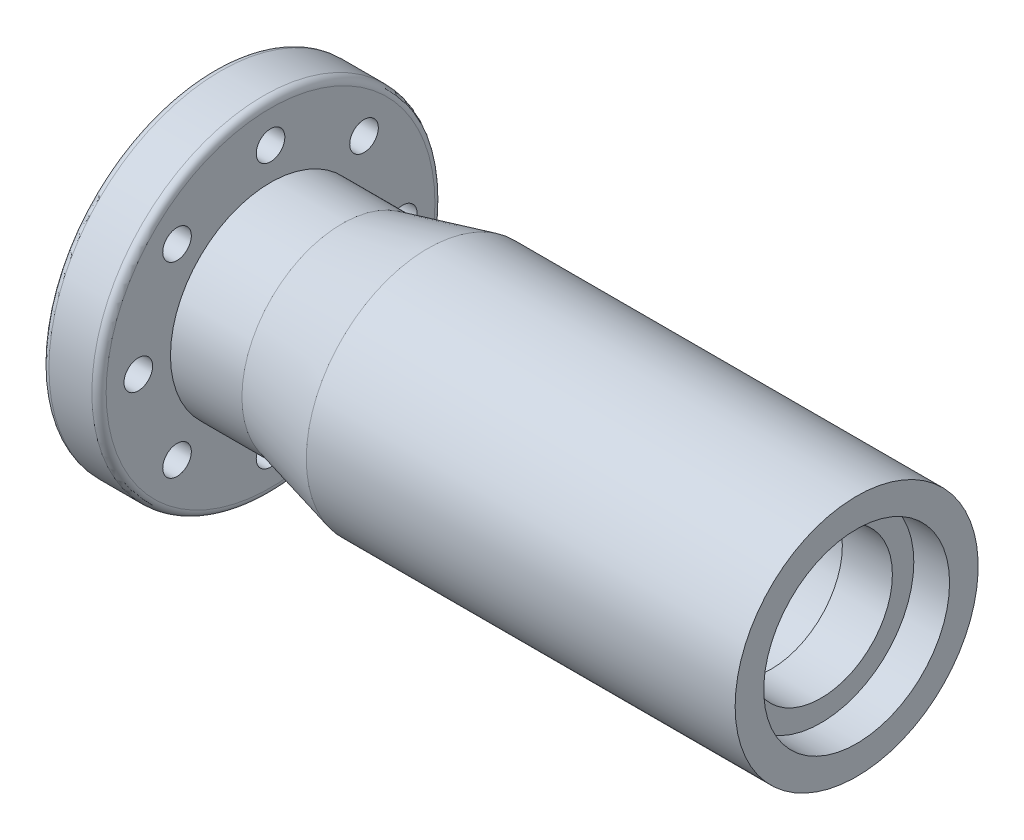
ISO-10303-21;
HEADER;
FILE_DESCRIPTION(('STEP AP214'),'2;1');
FILE_NAME('part.step','',(''),(''),'','','');
FILE_SCHEMA(('AUTOMOTIVE_DESIGN { 1 0 10303 214 1 1 1 1 }'));
ENDSEC;
DATA;
#1=APPLICATION_CONTEXT('core data for automotive mechanical design processes');
#2=APPLICATION_PROTOCOL_DEFINITION('international standard','automotive_design',2000,#1);
#3=PRODUCT_CONTEXT('',#1,'mechanical');
#4=PRODUCT('Part','Part','',(#3));
#5=PRODUCT_RELATED_PRODUCT_CATEGORY('part','',(#4));
#6=PRODUCT_DEFINITION_FORMATION('','',#4);
#7=PRODUCT_DEFINITION_CONTEXT('part definition',#1,'design');
#8=PRODUCT_DEFINITION('design','',#6,#7);
#9=PRODUCT_DEFINITION_SHAPE('','',#8);
#10=(LENGTH_UNIT() NAMED_UNIT(*) SI_UNIT(.MILLI.,.METRE.));
#11=(NAMED_UNIT(*) PLANE_ANGLE_UNIT() SI_UNIT($,.RADIAN.));
#12=(NAMED_UNIT(*) SI_UNIT($,.STERADIAN.) SOLID_ANGLE_UNIT());
#13=UNCERTAINTY_MEASURE_WITH_UNIT(LENGTH_MEASURE(1.E-05),#10,'distance_accuracy_value','');
#14=(GEOMETRIC_REPRESENTATION_CONTEXT(3) GLOBAL_UNCERTAINTY_ASSIGNED_CONTEXT((#13)) GLOBAL_UNIT_ASSIGNED_CONTEXT((#10,
#11,#12)) REPRESENTATION_CONTEXT('',''));
#15=CARTESIAN_POINT('',(0.,0.,0.));
#16=DIRECTION('',(0.,0.,1.));
#17=DIRECTION('',(1.,0.,0.));
#18=AXIS2_PLACEMENT_3D('',#15,#16,#17);
#19=CARTESIAN_POINT('',(0.,0.,0.));
#20=DIRECTION('',(1.,0.,0.));
#21=DIRECTION('',(0.,0.,-1.));
#22=AXIS2_PLACEMENT_3D('',#19,#20,#21);
#23=CYLINDRICAL_SURFACE('',#22,10.);
#24=CARTESIAN_POINT('',(85.,0.,0.));
#25=DIRECTION('',(1.,0.,0.));
#26=DIRECTION('',(0.,0.,-1.));
#27=AXIS2_PLACEMENT_3D('',#24,#25,#26);
#28=CIRCLE('',#27,10.);
#29=CARTESIAN_POINT('',(85.,0.,-10.));
#30=VERTEX_POINT('',#29);
#31=EDGE_CURVE('E96',#30,#30,#28,.T.);
#32=ORIENTED_EDGE('',*,*,#31,.T.);
#33=EDGE_LOOP('',(#32));
#34=FACE_BOUND('',#33,.T.);
#35=CARTESIAN_POINT('',(78.,0.,0.));
#36=DIRECTION('',(-1.,0.,0.));
#37=DIRECTION('',(0.,0.,1.));
#38=AXIS2_PLACEMENT_3D('',#35,#36,#37);
#39=CIRCLE('',#38,10.);
#40=CARTESIAN_POINT('',(78.,0.,10.));
#41=VERTEX_POINT('',#40);
#42=EDGE_CURVE('E93',#41,#41,#39,.F.);
#43=ORIENTED_EDGE('',*,*,#42,.F.);
#44=EDGE_LOOP('',(#43));
#45=FACE_BOUND('',#44,.T.);
#46=ADVANCED_FACE('F33',(#34,#45),#23,.F.);
#47=CARTESIAN_POINT('',(0.,0.,0.));
#48=DIRECTION('',(1.,0.,0.));
#49=DIRECTION('',(0.,0.,-1.));
#50=AXIS2_PLACEMENT_3D('',#47,#48,#49);
#51=PLANE('',#50);
#52=CARTESIAN_POINT('',(0.,0.,0.));
#53=DIRECTION('',(1.,0.,0.));
#54=DIRECTION('',(0.,0.,-1.));
#55=AXIS2_PLACEMENT_3D('',#52,#53,#54);
#56=CIRCLE('',#55,23.);
#57=CARTESIAN_POINT('',(0.,0.,-23.));
#58=VERTEX_POINT('',#57);
#59=EDGE_CURVE('E10',#58,#58,#56,.F.);
#60=ORIENTED_EDGE('',*,*,#59,.T.);
#61=EDGE_LOOP('',(#60));
#62=FACE_BOUND('',#61,.T.);
#63=CARTESIAN_POINT('',(0.,13.0814754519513,13.081475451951));
#64=DIRECTION('',(-1.,0.,0.));
#65=DIRECTION('',(0.,-0.707106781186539,0.707106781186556));
#66=AXIS2_PLACEMENT_3D('',#63,#64,#65);
#67=CIRCLE('',#66,2.);
#68=CARTESIAN_POINT('',(0.,11.6672618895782,14.4956890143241));
#69=VERTEX_POINT('',#68);
#70=EDGE_CURVE('E58',#69,#69,#67,.T.);
#71=ORIENTED_EDGE('',*,*,#70,.F.);
#72=EDGE_LOOP('',(#71));
#73=FACE_BOUND('',#72,.T.);
#74=CARTESIAN_POINT('',(0.,1.93777326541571E-13,18.5));
#75=DIRECTION('',(-1.,0.,0.));
#76=DIRECTION('',(0.,-1.,0.));
#77=AXIS2_PLACEMENT_3D('',#74,#75,#76);
#78=CIRCLE('',#77,2.);
#79=CARTESIAN_POINT('',(0.,-1.99999999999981,18.5));
#80=VERTEX_POINT('',#79);
#81=EDGE_CURVE('E57',#80,#80,#78,.T.);
#82=ORIENTED_EDGE('',*,*,#81,.F.);
#83=EDGE_LOOP('',(#82));
#84=FACE_BOUND('',#83,.T.);
#85=CARTESIAN_POINT('',(0.,-13.081475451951,13.0814754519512));
#86=DIRECTION('',(-1.,0.,0.));
#87=DIRECTION('',(0.,-0.707106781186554,-0.707106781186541));
#88=AXIS2_PLACEMENT_3D('',#85,#86,#87);
#89=CIRCLE('',#88,2.);
#90=CARTESIAN_POINT('',(0.,-14.4956890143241,11.6672618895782));
#91=VERTEX_POINT('',#90);
#92=EDGE_CURVE('E62',#91,#91,#89,.T.);
#93=ORIENTED_EDGE('',*,*,#92,.F.);
#94=EDGE_LOOP('',(#93));
#95=FACE_BOUND('',#94,.T.);
#96=CARTESIAN_POINT('',(0.,-18.5,1.29184884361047E-13));
#97=DIRECTION('',(-1.,0.,0.));
#98=DIRECTION('',(0.,0.,-1.));
#99=AXIS2_PLACEMENT_3D('',#96,#97,#98);
#100=CIRCLE('',#99,2.);
#101=CARTESIAN_POINT('',(0.,-18.5,-1.99999999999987));
#102=VERTEX_POINT('',#101);
#103=EDGE_CURVE('E66',#102,#102,#100,.T.);
#104=ORIENTED_EDGE('',*,*,#103,.F.);
#105=EDGE_LOOP('',(#104));
#106=FACE_BOUND('',#105,.T.);
#107=CARTESIAN_POINT('',(0.,-13.0814754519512,-13.0814754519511));
#108=DIRECTION('',(-1.,0.,0.));
#109=DIRECTION('',(0.,0.707106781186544,-0.707106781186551));
#110=AXIS2_PLACEMENT_3D('',#107,#108,#109);
#111=CIRCLE('',#110,2.);
#112=CARTESIAN_POINT('',(0.,-11.6672618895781,-14.4956890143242));
#113=VERTEX_POINT('',#112);
#114=EDGE_CURVE('E70',#113,#113,#111,.T.);
#115=ORIENTED_EDGE('',*,*,#114,.F.);
#116=EDGE_LOOP('',(#115));
#117=FACE_BOUND('',#116,.T.);
#118=CARTESIAN_POINT('',(0.,0.,-18.5));
#119=DIRECTION('',(-1.,0.,0.));
#120=DIRECTION('',(0.,1.,0.));
#121=AXIS2_PLACEMENT_3D('',#118,#119,#120);
#122=CIRCLE('',#121,2.);
#123=CARTESIAN_POINT('',(0.,1.99999999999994,-18.5));
#124=VERTEX_POINT('',#123);
#125=EDGE_CURVE('E74',#124,#124,#122,.T.);
#126=ORIENTED_EDGE('',*,*,#125,.F.);
#127=EDGE_LOOP('',(#126));
#128=FACE_BOUND('',#127,.T.);
#129=CARTESIAN_POINT('',(0.,13.0814754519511,-13.0814754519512));
#130=DIRECTION('',(-1.,0.,0.));
#131=DIRECTION('',(0.,0.707106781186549,0.707106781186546));
#132=AXIS2_PLACEMENT_3D('',#129,#130,#131);
#133=CIRCLE('',#132,2.);
#134=CARTESIAN_POINT('',(0.,14.4956890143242,-11.6672618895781));
#135=VERTEX_POINT('',#134);
#136=EDGE_CURVE('E78',#135,#135,#133,.T.);
#137=ORIENTED_EDGE('',*,*,#136,.F.);
#138=EDGE_LOOP('',(#137));
#139=FACE_BOUND('',#138,.T.);
#140=CARTESIAN_POINT('',(0.,18.5,0.));
#141=DIRECTION('',(-1.,0.,0.));
#142=DIRECTION('',(0.,0.,1.));
#143=AXIS2_PLACEMENT_3D('',#140,#141,#142);
#144=CIRCLE('',#143,2.);
#145=CARTESIAN_POINT('',(0.,18.5,2.));
#146=VERTEX_POINT('',#145);
#147=EDGE_CURVE('E82',#146,#146,#144,.T.);
#148=ORIENTED_EDGE('',*,*,#147,.F.);
#149=EDGE_LOOP('',(#148));
#150=FACE_BOUND('',#149,.T.);
#151=CARTESIAN_POINT('',(0.,0.,0.));
#152=DIRECTION('',(1.,0.,0.));
#153=DIRECTION('',(0.,0.,-1.));
#154=AXIS2_PLACEMENT_3D('',#151,#152,#153);
#155=CIRCLE('',#154,12.5);
#156=CARTESIAN_POINT('',(0.,0.,-12.5));
#157=VERTEX_POINT('',#156);
#158=EDGE_CURVE('E53',#157,#157,#155,.T.);
#159=ORIENTED_EDGE('',*,*,#158,.T.);
#160=EDGE_LOOP('',(#159));
#161=FACE_BOUND('',#160,.T.);
#162=ADVANCED_FACE('F35',(#62,#73,#84,#95,#106,#117,#128,#139,#150,#161),#51,.F.);
#163=CARTESIAN_POINT('',(0.,0.,0.));
#164=DIRECTION('',(-1.,0.,0.));
#165=DIRECTION('',(0.,0.,1.));
#166=AXIS2_PLACEMENT_3D('',#163,#164,#165);
#167=CYLINDRICAL_SURFACE('',#166,24.);
#168=CARTESIAN_POINT('',(7.,0.,0.));
#169=DIRECTION('',(-1.,0.,0.));
#170=DIRECTION('',(0.,0.,1.));
#171=AXIS2_PLACEMENT_3D('',#168,#169,#170);
#172=CIRCLE('',#171,24.);
#173=CARTESIAN_POINT('',(7.,0.,24.));
#174=VERTEX_POINT('',#173);
#175=EDGE_CURVE('E44',#174,#174,#172,.T.);
#176=ORIENTED_EDGE('',*,*,#175,.T.);
#177=EDGE_LOOP('',(#176));
#178=FACE_BOUND('',#177,.T.);
#179=CARTESIAN_POINT('',(1.,0.,0.));
#180=DIRECTION('',(1.,0.,0.));
#181=DIRECTION('',(0.,0.,-1.));
#182=AXIS2_PLACEMENT_3D('',#179,#180,#181);
#183=CIRCLE('',#182,24.);
#184=CARTESIAN_POINT('',(1.,0.,-24.));
#185=VERTEX_POINT('',#184);
#186=EDGE_CURVE('E48',#185,#185,#183,.T.);
#187=ORIENTED_EDGE('',*,*,#186,.T.);
#188=EDGE_LOOP('',(#187));
#189=FACE_BOUND('',#188,.T.);
#190=ADVANCED_FACE('F140',(#178,#189),#167,.T.);
#191=CARTESIAN_POINT('',(8.,24.,0.));
#192=DIRECTION('',(-1.,0.,0.));
#193=DIRECTION('',(0.,0.,1.));
#194=AXIS2_PLACEMENT_3D('',#191,#192,#193);
#195=PLANE('',#194);
#196=CARTESIAN_POINT('',(8.,0.,0.));
#197=DIRECTION('',(-1.,0.,0.));
#198=DIRECTION('',(0.,0.,1.));
#199=AXIS2_PLACEMENT_3D('',#196,#197,#198);
#200=CIRCLE('',#199,23.);
#201=CARTESIAN_POINT('',(8.,0.,23.));
#202=VERTEX_POINT('',#201);
#203=EDGE_CURVE('E40',#202,#202,#200,.F.);
#204=ORIENTED_EDGE('',*,*,#203,.T.);
#205=EDGE_LOOP('',(#204));
#206=FACE_BOUND('',#205,.T.);
#207=CARTESIAN_POINT('',(8.,13.0814754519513,13.081475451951));
#208=DIRECTION('',(-1.,0.,0.));
#209=DIRECTION('',(0.,0.,1.));
#210=AXIS2_PLACEMENT_3D('',#207,#208,#209);
#211=CIRCLE('',#210,2.);
#212=CARTESIAN_POINT('',(8.,13.0814754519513,15.081475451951));
#213=VERTEX_POINT('',#212);
#214=EDGE_CURVE('E54',#213,#213,#211,.T.);
#215=ORIENTED_EDGE('',*,*,#214,.T.);
#216=EDGE_LOOP('',(#215));
#217=FACE_BOUND('',#216,.T.);
#218=CARTESIAN_POINT('',(8.,1.93777326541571E-13,18.5));
#219=DIRECTION('',(-1.,0.,0.));
#220=DIRECTION('',(0.,0.,1.));
#221=AXIS2_PLACEMENT_3D('',#218,#219,#220);
#222=CIRCLE('',#221,2.);
#223=CARTESIAN_POINT('',(8.,1.93777326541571E-13,20.5));
#224=VERTEX_POINT('',#223);
#225=EDGE_CURVE('E59',#224,#224,#222,.T.);
#226=ORIENTED_EDGE('',*,*,#225,.T.);
#227=EDGE_LOOP('',(#226));
#228=FACE_BOUND('',#227,.T.);
#229=CARTESIAN_POINT('',(8.,-13.081475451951,13.0814754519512));
#230=DIRECTION('',(-1.,0.,0.));
#231=DIRECTION('',(0.,0.,1.));
#232=AXIS2_PLACEMENT_3D('',#229,#230,#231);
#233=CIRCLE('',#232,2.);
#234=CARTESIAN_POINT('',(8.,-13.081475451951,15.0814754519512));
#235=VERTEX_POINT('',#234);
#236=EDGE_CURVE('E63',#235,#235,#233,.T.);
#237=ORIENTED_EDGE('',*,*,#236,.T.);
#238=EDGE_LOOP('',(#237));
#239=FACE_BOUND('',#238,.T.);
#240=CARTESIAN_POINT('',(8.,-18.5,1.29184884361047E-13));
#241=DIRECTION('',(-1.,0.,0.));
#242=DIRECTION('',(0.,0.,1.));
#243=AXIS2_PLACEMENT_3D('',#240,#241,#242);
#244=CIRCLE('',#243,2.);
#245=CARTESIAN_POINT('',(8.,-18.5,2.00000000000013));
#246=VERTEX_POINT('',#245);
#247=EDGE_CURVE('E67',#246,#246,#244,.T.);
#248=ORIENTED_EDGE('',*,*,#247,.T.);
#249=EDGE_LOOP('',(#248));
#250=FACE_BOUND('',#249,.T.);
#251=CARTESIAN_POINT('',(8.,-13.0814754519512,-13.0814754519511));
#252=DIRECTION('',(-1.,0.,0.));
#253=DIRECTION('',(0.,0.,1.));
#254=AXIS2_PLACEMENT_3D('',#251,#252,#253);
#255=CIRCLE('',#254,2.);
#256=CARTESIAN_POINT('',(8.,-13.0814754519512,-11.0814754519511));
#257=VERTEX_POINT('',#256);
#258=EDGE_CURVE('E71',#257,#257,#255,.T.);
#259=ORIENTED_EDGE('',*,*,#258,.T.);
#260=EDGE_LOOP('',(#259));
#261=FACE_BOUND('',#260,.T.);
#262=CARTESIAN_POINT('',(8.,0.,-18.5));
#263=DIRECTION('',(-1.,0.,0.));
#264=DIRECTION('',(0.,0.,1.));
#265=AXIS2_PLACEMENT_3D('',#262,#263,#264);
#266=CIRCLE('',#265,2.);
#267=CARTESIAN_POINT('',(8.,0.,-16.5));
#268=VERTEX_POINT('',#267);
#269=EDGE_CURVE('E75',#268,#268,#266,.T.);
#270=ORIENTED_EDGE('',*,*,#269,.T.);
#271=EDGE_LOOP('',(#270));
#272=FACE_BOUND('',#271,.T.);
#273=CARTESIAN_POINT('',(8.,13.0814754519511,-13.0814754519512));
#274=DIRECTION('',(-1.,0.,0.));
#275=DIRECTION('',(0.,0.,1.));
#276=AXIS2_PLACEMENT_3D('',#273,#274,#275);
#277=CIRCLE('',#276,2.);
#278=CARTESIAN_POINT('',(8.,13.0814754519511,-11.0814754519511));
#279=VERTEX_POINT('',#278);
#280=EDGE_CURVE('E79',#279,#279,#277,.T.);
#281=ORIENTED_EDGE('',*,*,#280,.T.);
#282=EDGE_LOOP('',(#281));
#283=FACE_BOUND('',#282,.T.);
#284=CARTESIAN_POINT('',(8.,18.5,0.));
#285=DIRECTION('',(-1.,0.,0.));
#286=DIRECTION('',(0.,0.,1.));
#287=AXIS2_PLACEMENT_3D('',#284,#285,#286);
#288=CIRCLE('',#287,2.);
#289=CARTESIAN_POINT('',(8.,18.5,2.));
#290=VERTEX_POINT('',#289);
#291=EDGE_CURVE('E83',#290,#290,#288,.T.);
#292=ORIENTED_EDGE('',*,*,#291,.T.);
#293=EDGE_LOOP('',(#292));
#294=FACE_BOUND('',#293,.T.);
#295=CARTESIAN_POINT('',(8.,0.,0.));
#296=DIRECTION('',(-1.,0.,0.));
#297=DIRECTION('',(0.,0.,1.));
#298=AXIS2_PLACEMENT_3D('',#295,#296,#297);
#299=CIRCLE('',#298,14.);
#300=CARTESIAN_POINT('',(8.,0.,14.));
#301=VERTEX_POINT('',#300);
#302=EDGE_CURVE('E92',#301,#301,#299,.T.);
#303=ORIENTED_EDGE('',*,*,#302,.T.);
#304=EDGE_LOOP('',(#303));
#305=FACE_BOUND('',#304,.T.);
#306=ADVANCED_FACE('F205',(#206,#217,#228,#239,#250,#261,#272,#283,#294,#305),#195,.F.);
#307=CARTESIAN_POINT('',(0.,0.,0.));
#308=DIRECTION('',(-1.,0.,0.));
#309=DIRECTION('',(0.,0.,1.));
#310=AXIS2_PLACEMENT_3D('',#307,#308,#309);
#311=CYLINDRICAL_SURFACE('',#310,14.);
#312=ORIENTED_EDGE('',*,*,#302,.F.);
#313=EDGE_LOOP('',(#312));
#314=FACE_BOUND('',#313,.T.);
#315=CARTESIAN_POINT('',(18.,0.,0.));
#316=DIRECTION('',(-1.,0.,0.));
#317=DIRECTION('',(0.,0.,1.));
#318=AXIS2_PLACEMENT_3D('',#315,#316,#317);
#319=CIRCLE('',#318,14.);
#320=CARTESIAN_POINT('',(18.,0.,14.));
#321=VERTEX_POINT('',#320);
#322=EDGE_CURVE('E99',#321,#321,#319,.T.);
#323=ORIENTED_EDGE('',*,*,#322,.T.);
#324=EDGE_LOOP('',(#323));
#325=FACE_BOUND('',#324,.T.);
#326=ADVANCED_FACE('F201',(#314,#325),#311,.T.);
#327=CARTESIAN_POINT('',(30.,0.,0.));
#328=DIRECTION('',(1.,0.,0.));
#329=DIRECTION('',(0.,0.,-1.));
#330=AXIS2_PLACEMENT_3D('',#327,#328,#329);
#331=CONICAL_SURFACE('',#330,17.,0.244978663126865);
#332=ORIENTED_EDGE('',*,*,#322,.F.);
#333=EDGE_LOOP('',(#332));
#334=FACE_BOUND('',#333,.T.);
#335=CARTESIAN_POINT('',(30.,0.,0.));
#336=DIRECTION('',(-1.,0.,0.));
#337=DIRECTION('',(0.,0.,1.));
#338=AXIS2_PLACEMENT_3D('',#335,#336,#337);
#339=CIRCLE('',#338,17.);
#340=CARTESIAN_POINT('',(30.,0.,17.));
#341=VERTEX_POINT('',#340);
#342=EDGE_CURVE('E102',#341,#341,#339,.T.);
#343=ORIENTED_EDGE('',*,*,#342,.T.);
#344=EDGE_LOOP('',(#343));
#345=FACE_BOUND('',#344,.T.);
#346=ADVANCED_FACE('F197',(#334,#345),#331,.T.);
#347=CARTESIAN_POINT('',(0.,0.,0.));
#348=DIRECTION('',(-1.,0.,0.));
#349=DIRECTION('',(0.,0.,1.));
#350=AXIS2_PLACEMENT_3D('',#347,#348,#349);
#351=CYLINDRICAL_SURFACE('',#350,17.);
#352=ORIENTED_EDGE('',*,*,#342,.F.);
#353=EDGE_LOOP('',(#352));
#354=FACE_BOUND('',#353,.T.);
#355=CARTESIAN_POINT('',(90.,0.,0.));
#356=DIRECTION('',(-1.,0.,0.));
#357=DIRECTION('',(0.,0.,1.));
#358=AXIS2_PLACEMENT_3D('',#355,#356,#357);
#359=CIRCLE('',#358,17.);
#360=CARTESIAN_POINT('',(90.,0.,17.));
#361=VERTEX_POINT('',#360);
#362=EDGE_CURVE('E105',#361,#361,#359,.T.);
#363=ORIENTED_EDGE('',*,*,#362,.T.);
#364=EDGE_LOOP('',(#363));
#365=FACE_BOUND('',#364,.T.);
#366=ADVANCED_FACE('F193',(#354,#365),#351,.T.);
#367=CARTESIAN_POINT('',(90.,17.,0.));
#368=DIRECTION('',(-1.,0.,0.));
#369=DIRECTION('',(0.,0.,1.));
#370=AXIS2_PLACEMENT_3D('',#367,#368,#369);
#371=PLANE('',#370);
#372=CARTESIAN_POINT('',(90.,0.,0.));
#373=DIRECTION('',(1.,0.,0.));
#374=DIRECTION('',(0.,0.,-1.));
#375=AXIS2_PLACEMENT_3D('',#372,#373,#374);
#376=CIRCLE('',#375,13.);
#377=CARTESIAN_POINT('',(90.,0.,-13.));
#378=VERTEX_POINT('',#377);
#379=EDGE_CURVE('E111',#378,#378,#376,.T.);
#380=ORIENTED_EDGE('',*,*,#379,.F.);
#381=EDGE_LOOP('',(#380));
#382=FACE_BOUND('',#381,.T.);
#383=ORIENTED_EDGE('',*,*,#362,.F.);
#384=EDGE_LOOP('',(#383));
#385=FACE_BOUND('',#384,.T.);
#386=ADVANCED_FACE('F189',(#382,#385),#371,.F.);
#387=CARTESIAN_POINT('',(85.,0.,0.));
#388=DIRECTION('',(1.,0.,0.));
#389=DIRECTION('',(0.,0.,-1.));
#390=AXIS2_PLACEMENT_3D('',#387,#388,#389);
#391=CYLINDRICAL_SURFACE('',#390,13.);
#392=CARTESIAN_POINT('',(85.,0.,0.));
#393=DIRECTION('',(1.,0.,0.));
#394=DIRECTION('',(0.,0.,-1.));
#395=AXIS2_PLACEMENT_3D('',#392,#393,#394);
#396=CIRCLE('',#395,13.);
#397=CARTESIAN_POINT('',(85.,0.,-13.));
#398=VERTEX_POINT('',#397);
#399=EDGE_CURVE('E108',#398,#398,#396,.T.);
#400=ORIENTED_EDGE('',*,*,#399,.F.);
#401=EDGE_LOOP('',(#400));
#402=FACE_BOUND('',#401,.T.);
#403=ORIENTED_EDGE('',*,*,#379,.T.);
#404=EDGE_LOOP('',(#403));
#405=FACE_BOUND('',#404,.T.);
#406=ADVANCED_FACE('F185',(#402,#405),#391,.F.);
#407=CARTESIAN_POINT('',(85.,0.,0.));
#408=DIRECTION('',(1.,0.,0.));
#409=DIRECTION('',(0.,0.,-1.));
#410=AXIS2_PLACEMENT_3D('',#407,#408,#409);
#411=PLANE('',#410);
#412=ORIENTED_EDGE('',*,*,#31,.F.);
#413=EDGE_LOOP('',(#412));
#414=FACE_BOUND('',#413,.T.);
#415=ORIENTED_EDGE('',*,*,#399,.T.);
#416=EDGE_LOOP('',(#415));
#417=FACE_BOUND('',#416,.T.);
#418=ADVANCED_FACE('F173',(#414,#417),#411,.T.);
#419=CARTESIAN_POINT('',(78.,0.,0.));
#420=DIRECTION('',(-1.,0.,0.));
#421=DIRECTION('',(0.,0.,1.));
#422=AXIS2_PLACEMENT_3D('',#419,#420,#421);
#423=PLANE('',#422);
#424=CARTESIAN_POINT('',(78.,0.,0.));
#425=DIRECTION('',(-1.,0.,0.));
#426=DIRECTION('',(0.,0.,1.));
#427=AXIS2_PLACEMENT_3D('',#424,#425,#426);
#428=CIRCLE('',#427,11.5);
#429=CARTESIAN_POINT('',(78.,0.,11.5));
#430=VERTEX_POINT('',#429);
#431=EDGE_CURVE('E86',#430,#430,#428,.T.);
#432=ORIENTED_EDGE('',*,*,#431,.T.);
#433=EDGE_LOOP('',(#432));
#434=FACE_BOUND('',#433,.T.);
#435=ORIENTED_EDGE('',*,*,#42,.T.);
#436=EDGE_LOOP('',(#435));
#437=FACE_BOUND('',#436,.T.);
#438=ADVANCED_FACE('F167',(#434,#437),#423,.T.);
#439=CARTESIAN_POINT('',(78.,0.,0.));
#440=DIRECTION('',(-1.,0.,0.));
#441=DIRECTION('',(0.,0.,1.));
#442=AXIS2_PLACEMENT_3D('',#439,#440,#441);
#443=CYLINDRICAL_SURFACE('',#442,11.5);
#444=CARTESIAN_POINT('',(1.,0.,0.));
#445=DIRECTION('',(1.,0.,0.));
#446=DIRECTION('',(0.,0.,-1.));
#447=AXIS2_PLACEMENT_3D('',#444,#445,#446);
#448=CIRCLE('',#447,11.5);
#449=CARTESIAN_POINT('',(1.,0.,-11.5));
#450=VERTEX_POINT('',#449);
#451=EDGE_CURVE('E89',#450,#450,#448,.F.);
#452=ORIENTED_EDGE('',*,*,#451,.T.);
#453=EDGE_LOOP('',(#452));
#454=FACE_BOUND('',#453,.T.);
#455=ORIENTED_EDGE('',*,*,#431,.F.);
#456=EDGE_LOOP('',(#455));
#457=FACE_BOUND('',#456,.T.);
#458=ADVANCED_FACE('F161',(#454,#457),#443,.F.);
#459=CARTESIAN_POINT('',(1.,0.,0.));
#460=DIRECTION('',(-1.,0.,0.));
#461=DIRECTION('',(0.,0.,1.));
#462=AXIS2_PLACEMENT_3D('',#459,#460,#461);
#463=CONICAL_SURFACE('',#462,11.5,0.785398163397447);
#464=ORIENTED_EDGE('',*,*,#158,.F.);
#465=EDGE_LOOP('',(#464));
#466=FACE_BOUND('',#465,.T.);
#467=ORIENTED_EDGE('',*,*,#451,.F.);
#468=EDGE_LOOP('',(#467));
#469=FACE_BOUND('',#468,.T.);
#470=ADVANCED_FACE('F157',(#466,#469),#463,.F.);
#471=CARTESIAN_POINT('',(10.,18.5,0.));
#472=DIRECTION('',(-1.,0.,0.));
#473=DIRECTION('',(0.,0.,1.));
#474=AXIS2_PLACEMENT_3D('',#471,#472,#473);
#475=CYLINDRICAL_SURFACE('',#474,2.);
#476=ORIENTED_EDGE('',*,*,#147,.T.);
#477=EDGE_LOOP('',(#476));
#478=FACE_BOUND('',#477,.T.);
#479=ORIENTED_EDGE('',*,*,#291,.F.);
#480=EDGE_LOOP('',(#479));
#481=FACE_BOUND('',#480,.T.);
#482=ADVANCED_FACE('F160',(#478,#481),#475,.F.);
#483=CARTESIAN_POINT('',(10.,13.0814754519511,-13.0814754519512));
#484=DIRECTION('',(-1.,0.,0.));
#485=DIRECTION('',(0.,0.,1.));
#486=AXIS2_PLACEMENT_3D('',#483,#484,#485);
#487=CYLINDRICAL_SURFACE('',#486,2.);
#488=ORIENTED_EDGE('',*,*,#136,.T.);
#489=EDGE_LOOP('',(#488));
#490=FACE_BOUND('',#489,.T.);
#491=ORIENTED_EDGE('',*,*,#280,.F.);
#492=EDGE_LOOP('',(#491));
#493=FACE_BOUND('',#492,.T.);
#494=ADVANCED_FACE('F248',(#490,#493),#487,.F.);
#495=CARTESIAN_POINT('',(10.,0.,-18.5));
#496=DIRECTION('',(-1.,0.,0.));
#497=DIRECTION('',(0.,0.,1.));
#498=AXIS2_PLACEMENT_3D('',#495,#496,#497);
#499=CYLINDRICAL_SURFACE('',#498,2.);
#500=ORIENTED_EDGE('',*,*,#125,.T.);
#501=EDGE_LOOP('',(#500));
#502=FACE_BOUND('',#501,.T.);
#503=ORIENTED_EDGE('',*,*,#269,.F.);
#504=EDGE_LOOP('',(#503));
#505=FACE_BOUND('',#504,.T.);
#506=ADVANCED_FACE('F244',(#502,#505),#499,.F.);
#507=CARTESIAN_POINT('',(10.,-13.0814754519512,-13.0814754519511));
#508=DIRECTION('',(-1.,0.,0.));
#509=DIRECTION('',(0.,0.,1.));
#510=AXIS2_PLACEMENT_3D('',#507,#508,#509);
#511=CYLINDRICAL_SURFACE('',#510,2.);
#512=ORIENTED_EDGE('',*,*,#114,.T.);
#513=EDGE_LOOP('',(#512));
#514=FACE_BOUND('',#513,.T.);
#515=ORIENTED_EDGE('',*,*,#258,.F.);
#516=EDGE_LOOP('',(#515));
#517=FACE_BOUND('',#516,.T.);
#518=ADVANCED_FACE('F240',(#514,#517),#511,.F.);
#519=CARTESIAN_POINT('',(10.,-18.5,1.29184884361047E-13));
#520=DIRECTION('',(-1.,0.,0.));
#521=DIRECTION('',(0.,0.,1.));
#522=AXIS2_PLACEMENT_3D('',#519,#520,#521);
#523=CYLINDRICAL_SURFACE('',#522,2.);
#524=ORIENTED_EDGE('',*,*,#103,.T.);
#525=EDGE_LOOP('',(#524));
#526=FACE_BOUND('',#525,.T.);
#527=ORIENTED_EDGE('',*,*,#247,.F.);
#528=EDGE_LOOP('',(#527));
#529=FACE_BOUND('',#528,.T.);
#530=ADVANCED_FACE('F236',(#526,#529),#523,.F.);
#531=CARTESIAN_POINT('',(10.,-13.081475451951,13.0814754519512));
#532=DIRECTION('',(-1.,0.,0.));
#533=DIRECTION('',(0.,0.,1.));
#534=AXIS2_PLACEMENT_3D('',#531,#532,#533);
#535=CYLINDRICAL_SURFACE('',#534,2.);
#536=ORIENTED_EDGE('',*,*,#92,.T.);
#537=EDGE_LOOP('',(#536));
#538=FACE_BOUND('',#537,.T.);
#539=ORIENTED_EDGE('',*,*,#236,.F.);
#540=EDGE_LOOP('',(#539));
#541=FACE_BOUND('',#540,.T.);
#542=ADVANCED_FACE('F232',(#538,#541),#535,.F.);
#543=CARTESIAN_POINT('',(10.,1.93777326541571E-13,18.5));
#544=DIRECTION('',(-1.,0.,0.));
#545=DIRECTION('',(0.,0.,1.));
#546=AXIS2_PLACEMENT_3D('',#543,#544,#545);
#547=CYLINDRICAL_SURFACE('',#546,2.);
#548=ORIENTED_EDGE('',*,*,#81,.T.);
#549=EDGE_LOOP('',(#548));
#550=FACE_BOUND('',#549,.T.);
#551=ORIENTED_EDGE('',*,*,#225,.F.);
#552=EDGE_LOOP('',(#551));
#553=FACE_BOUND('',#552,.T.);
#554=ADVANCED_FACE('F229',(#550,#553),#547,.F.);
#555=CARTESIAN_POINT('',(10.,13.0814754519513,13.081475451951));
#556=DIRECTION('',(-1.,0.,0.));
#557=DIRECTION('',(0.,0.,1.));
#558=AXIS2_PLACEMENT_3D('',#555,#556,#557);
#559=CYLINDRICAL_SURFACE('',#558,2.);
#560=ORIENTED_EDGE('',*,*,#70,.T.);
#561=EDGE_LOOP('',(#560));
#562=FACE_BOUND('',#561,.T.);
#563=ORIENTED_EDGE('',*,*,#214,.F.);
#564=EDGE_LOOP('',(#563));
#565=FACE_BOUND('',#564,.T.);
#566=ADVANCED_FACE('F135',(#562,#565),#559,.F.);
#567=CARTESIAN_POINT('',(7.,0.,0.));
#568=DIRECTION('',(-1.,0.,0.));
#569=DIRECTION('',(0.,0.,1.));
#570=AXIS2_PLACEMENT_3D('',#567,#568,#569);
#571=TOROIDAL_SURFACE('',#570,23.,1.);
#572=ORIENTED_EDGE('',*,*,#203,.F.);
#573=EDGE_LOOP('',(#572));
#574=FACE_BOUND('',#573,.T.);
#575=ORIENTED_EDGE('',*,*,#175,.F.);
#576=EDGE_LOOP('',(#575));
#577=FACE_BOUND('',#576,.T.);
#578=ADVANCED_FACE('F219',(#574,#577),#571,.T.);
#579=CARTESIAN_POINT('',(1.,0.,0.));
#580=DIRECTION('',(1.,0.,0.));
#581=DIRECTION('',(0.,0.,-1.));
#582=AXIS2_PLACEMENT_3D('',#579,#580,#581);
#583=TOROIDAL_SURFACE('',#582,23.,1.);
#584=ORIENTED_EDGE('',*,*,#186,.F.);
#585=EDGE_LOOP('',(#584));
#586=FACE_BOUND('',#585,.T.);
#587=ORIENTED_EDGE('',*,*,#59,.F.);
#588=EDGE_LOOP('',(#587));
#589=FACE_BOUND('',#588,.T.);
#590=ADVANCED_FACE('F216',(#586,#589),#583,.T.);
#591=CLOSED_SHELL('',(#46,#162,#190,#306,#326,#346,#366,#386,#406,#418,#438,#458,#470,#482,#494,
#506,#518,#530,#542,#554,#566,#578,#590));
#592=MANIFOLD_SOLID_BREP('B2',#591);
#593=ADVANCED_BREP_SHAPE_REPRESENTATION('',(#18,#592),#14);
#594=SHAPE_DEFINITION_REPRESENTATION(#9,#593);
ENDSEC;
END-ISO-10303-21;
